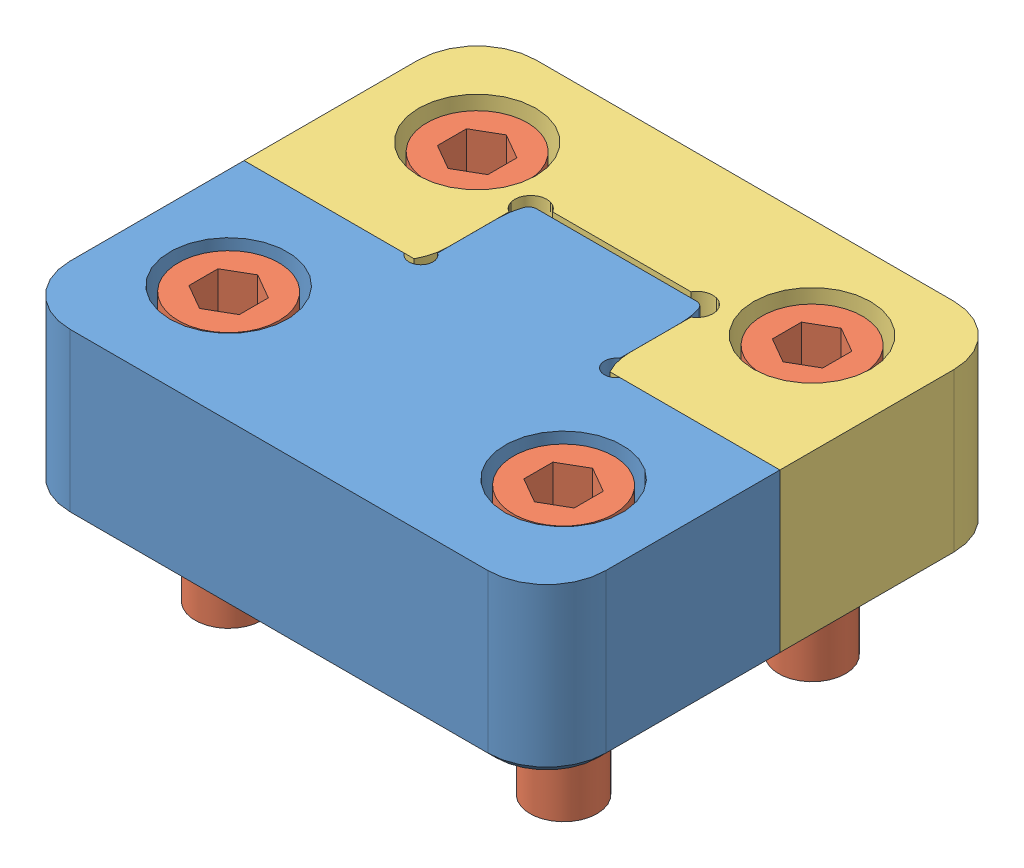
SolidWorks assembly SL62X200.SLDASM, configuration Default (file format 13000). Lengths in mm.
Overall size (50.8 26.19 44.2).
8 component instances, 3 part files, 6 mates.
Components (placement in the parent):
- SL62X200-M-1: SL62X200-M.SLDASM [Default] at origin size (50.8 25.91 32)
  - SL62X200 MALE-1: SL62X200 MALE.sldprt [Default] at origin size (50.8 15.75 32)
  - SHCS25-20L.75-1: SHCS25-20L.75.sldprt [SHCS25-20L.75] at (15.875 -6.858 10.9855) x (1 0 0) z (0 -1 0) size (9.53 9.53 25.4)
  - SHCS25-20L.75-2: SHCS25-20L.75.sldprt [SHCS25-20L.75] at (-15.875 -6.858 10.9855) x (1 0 0) z (0 -1 0) size (9.53 9.53 25.4)
- SL62X200-F-1: SL62X200-F.SLDASM [Default] at origin size (50.8 26.19 22.1)
  - SL62X200 FEMALE-1: SL62X200 FEMALE.sldprt [Default] at origin size (50.8 15.75 22.1)
  - SHCS25-20L.75-1: SHCS25-20L.75.sldprt [SHCS25-20L.75] at (15.875 -7.1437 -12.573) x (1 0 0) z (0 -1 0) size (9.53 9.53 25.4)
  - SHCS25-20L.75-2: SHCS25-20L.75.sldprt [SHCS25-20L.75] at (-15.875 -7.1437 -12.573) x (1 0 0) z (0 -1 0) size (9.53 9.53 25.4)
Mates (geometry in assembly coordinates):
- Coincident7: coincident aligned: plane of SLC62X200-M-1/SLC62X200 MALE-1 through (0 0 0) normal (0 1 0); plane of assembly through (0 0 0) normal (0 1 0)
- Coincident8: coincident aligned: plane of SLC62X200-M-1/SLC62X200 MALE-1 through (0 0 0) normal (0 0 1); plane of assembly through (0 0 0) normal (0 0 1)
- Coincident9: coincident aligned: plane of SLC62X200-M-1/SLC62X200 MALE-1 through (0 0 0) normal (1 0 0); plane of assembly through (0 0 0) normal (1 0 0)
- Coincident10: coincident aligned: plane of SLC62X200-F-1/SLC62X200 FEMALE-1 through (0 0 0) normal (0 1 0); plane of assembly through (0 0 0) normal (0 1 0)
- Coincident11: coincident aligned: plane of SLC62X200-F-1/SLC62X200 FEMALE-1 through (0 0 0) normal (1 0 0); plane of assembly through (0 0 0) normal (1 0 0)
- Distance4: distance anti-aligned: plane of SLC62X200-M-1/SLC62X200 MALE-1 through (8.6335 -15.748 0) normal (0 0 -1); plane of SLC62X200-F-1/SLC62X200 FEMALE-1 through (8.636 -15.748 0) normal (0 0 1)
